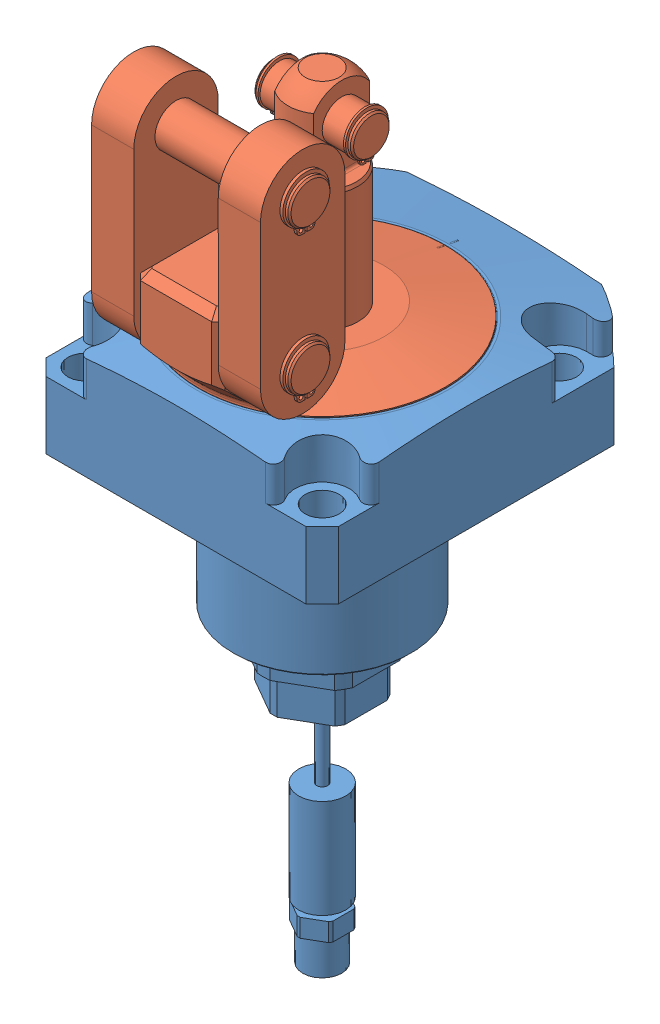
SolidWorks assembly ilc16322800US.SLDASM, configuration Default (file format 13000). Lengths in mm.
Overall size (89.99 245.71 100.99).
2 component instances, 2 part files, 3 mates.
Components (placement in the parent):
- ilc16322800US_BODY-1: ilc16322800US_BODY.SLDPRT [Default] at origin size (89.99 172.03 100.99)
- ilc16322800US_LUG-1: ilc16322800US_LUG.SLDPRT [Default] at (0 21.2344 0) size (75.69 86.5 82.85)
Mates (geometry in assembly coordinates):
- Coincident1: coincident anti-aligned: plane of ilc16322800US_BODY-1 through (37.8968 21.2344 0) normal (0 1 0); plane of ilc16322800_LUG-1 through (-13 21.2344 0) normal (0 -1 0)
- Concentric1: concentric anti-aligned: cylinder of ilc16322800US_BODY-1 through (0 -8.9689 0) axis (0 -1 0) radius 37.8968; cylinder of ilc16322800_LUG-1 through (0 37.8657 0) axis (0 1 0) radius 37.846
- LUG ANGLE: planar angle = 3.141593 rad anti-aligned: plane of ilc16322800_LUG-1 through (0 21.2344 0) normal (1 0 0)
